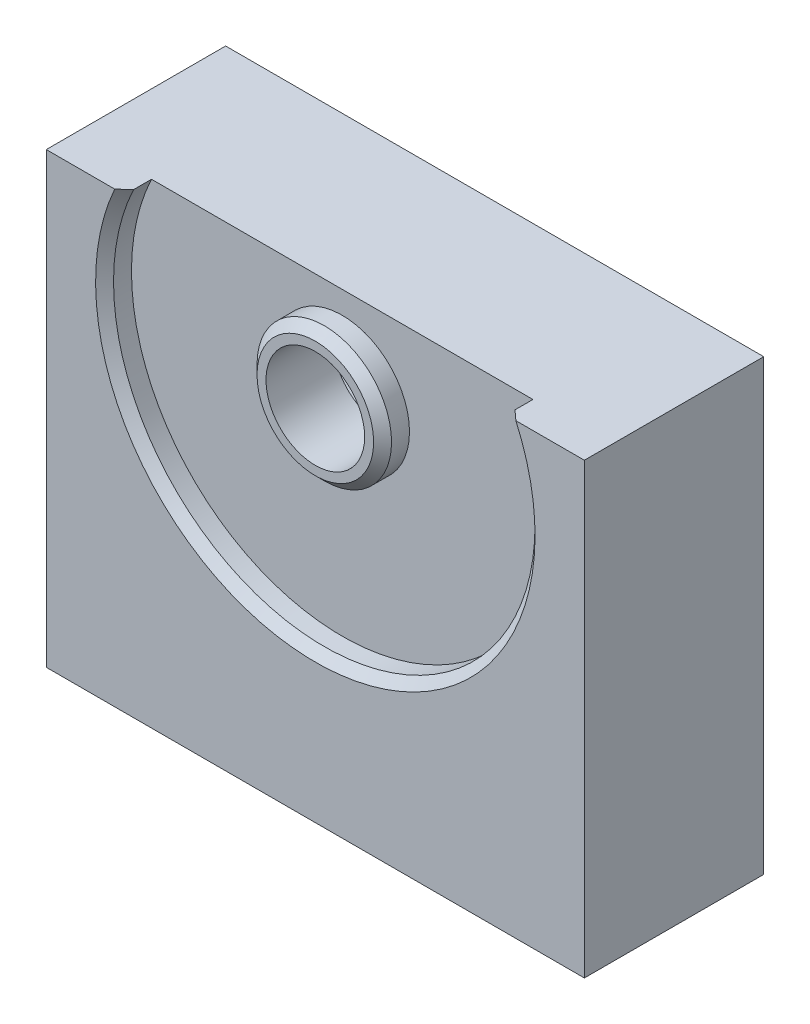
from build123d import *

# Parameters (mm, degrees)
ESQUISSE1_W                         = 60
ESQUISSE1_H                         = 50
BOSS_EXTRU_1_DEPTH                  = 20
ESQUISSE2_R                         = 23.5
ESQUISSE2_R_2                       = 7.5
ENL_V_MAT_EXTRU_1_DEPTH             = 3
CHANFREIN1_SIZE                     = 1
DIAM_TRE_DU_PER_AGE_11_0_11_1_D     = 11
DIAM_TRE_DU_PER_AGE_11_0_11_1_DEPTH = 7.5
DIAM_TRE_DU_PER_AGE_11_0_11_1_TIP   = 3.304733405


with BuildPart() as part:
    # Esquisse1 → Boss.-Extru.1 (new body)
    with BuildSketch(Plane.XY):
        with Locations((30, 25)):
            Rectangle(ESQUISSE1_W, ESQUISSE1_H)
    extrude(amount=BOSS_EXTRU_1_DEPTH)

    # Esquisse2 → Enl_v. mat.-Extru.1 (cut)
    with BuildSketch(Plane.XY.offset(20)):
        with Locations((30, 40)):
            Circle(ESQUISSE2_R)
        with Locations((30, 40)):
            Circle(ESQUISSE2_R_2, mode=Mode.SUBTRACT)
    extrude(amount=-ENL_V_MAT_EXTRU_1_DEPTH, mode=Mode.SUBTRACT)

    # Chanfrein1
    chanfrein1_edges = [part.edges().sort_by_distance(p)[0] for p in [
        (30, 16.5, 20),
        (22.5, 40, 20),
    ]]
    chamfer(chanfrein1_edges, length=CHANFREIN1_SIZE)

    # Diam_tre du per_age _11.0 _11_1
    with Locations(Plane.XY.offset(20)):
        with Locations((30, 40)):
            Hole(DIAM_TRE_DU_PER_AGE_11_0_11_1_D / 2, depth=DIAM_TRE_DU_PER_AGE_11_0_11_1_DEPTH)
            with Locations((0, 0, -(DIAM_TRE_DU_PER_AGE_11_0_11_1_DEPTH + DIAM_TRE_DU_PER_AGE_11_0_11_1_TIP / 2))):  # 118° drill point
                Cone(0, DIAM_TRE_DU_PER_AGE_11_0_11_1_D / 2, DIAM_TRE_DU_PER_AGE_11_0_11_1_TIP, mode=Mode.SUBTRACT)


solid = part.part
